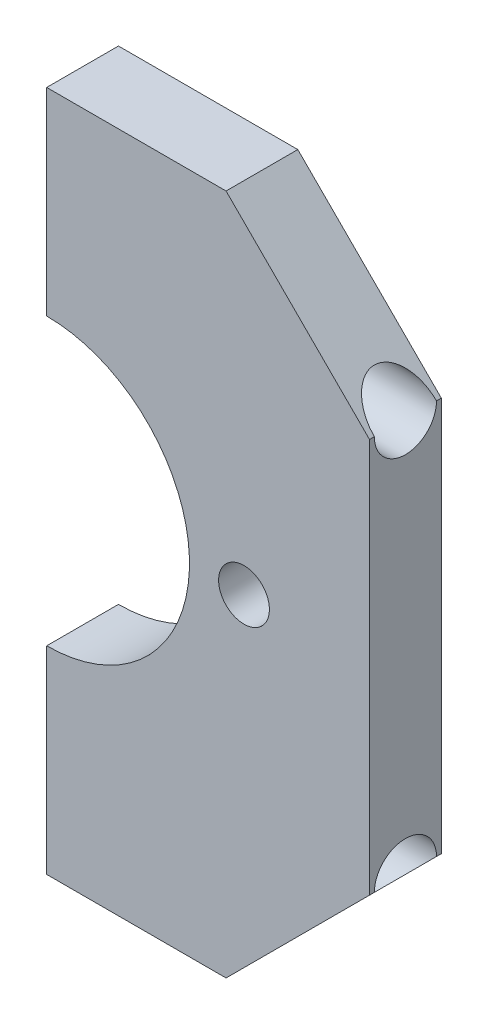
ISO-10303-21;
HEADER;
FILE_DESCRIPTION(('STEP AP214'),'2;1');
FILE_NAME('part.step','',(''),(''),'','','');
FILE_SCHEMA(('AUTOMOTIVE_DESIGN { 1 0 10303 214 1 1 1 1 }'));
ENDSEC;
DATA;
#1=APPLICATION_CONTEXT('core data for automotive mechanical design processes');
#2=APPLICATION_PROTOCOL_DEFINITION('international standard','automotive_design',2000,#1);
#3=PRODUCT_CONTEXT('',#1,'mechanical');
#4=PRODUCT('Part','Part','',(#3));
#5=PRODUCT_RELATED_PRODUCT_CATEGORY('part','',(#4));
#6=PRODUCT_DEFINITION_FORMATION('','',#4);
#7=PRODUCT_DEFINITION_CONTEXT('part definition',#1,'design');
#8=PRODUCT_DEFINITION('design','',#6,#7);
#9=PRODUCT_DEFINITION_SHAPE('','',#8);
#10=(LENGTH_UNIT() NAMED_UNIT(*) SI_UNIT(.MILLI.,.METRE.));
#11=(NAMED_UNIT(*) PLANE_ANGLE_UNIT() SI_UNIT($,.RADIAN.));
#12=(NAMED_UNIT(*) SI_UNIT($,.STERADIAN.) SOLID_ANGLE_UNIT());
#13=UNCERTAINTY_MEASURE_WITH_UNIT(LENGTH_MEASURE(1.E-05),#10,'distance_accuracy_value','');
#14=(GEOMETRIC_REPRESENTATION_CONTEXT(3) GLOBAL_UNCERTAINTY_ASSIGNED_CONTEXT((#13)) GLOBAL_UNIT_ASSIGNED_CONTEXT((#10,
#11,#12)) REPRESENTATION_CONTEXT('',''));
#15=CARTESIAN_POINT('',(0.,0.,0.));
#16=DIRECTION('',(0.,0.,1.));
#17=DIRECTION('',(1.,0.,0.));
#18=AXIS2_PLACEMENT_3D('',#15,#16,#17);
#19=CARTESIAN_POINT('',(57.15,-60.325,12.7));
#20=DIRECTION('',(-1.,0.,0.));
#21=DIRECTION('',(0.,0.,1.));
#22=AXIS2_PLACEMENT_3D('',#19,#20,#21);
#23=PLANE('',#22);
#24=CARTESIAN_POINT('',(57.15,34.925,6.35));
#25=DIRECTION('',(1.,0.,0.));
#26=DIRECTION('',(0.,0.,-1.));
#27=AXIS2_PLACEMENT_3D('',#24,#25,#26);
#28=CIRCLE('',#27,5.49910000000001);
#29=CARTESIAN_POINT('',(57.15,34.9249999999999,11.8491));
#30=VERTEX_POINT('',#29);
#31=CARTESIAN_POINT('',(57.15,34.9249999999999,0.850899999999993));
#32=VERTEX_POINT('',#31);
#33=EDGE_CURVE('E42',#30,#32,#28,.T.);
#34=ORIENTED_EDGE('',*,*,#33,.F.);
#35=DIRECTION('',(0.,0.,1.));
#36=VECTOR('',#35,1.);
#37=CARTESIAN_POINT('',(57.15,34.9249999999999,12.7));
#38=LINE('',#37,#36);
#39=CARTESIAN_POINT('',(57.15,34.9249999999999,12.7));
#40=VERTEX_POINT('',#39);
#41=EDGE_CURVE('E118',#30,#40,#38,.T.);
#42=ORIENTED_EDGE('',*,*,#41,.T.);
#43=DIRECTION('',(0.,1.,0.));
#44=VECTOR('',#43,1.);
#45=CARTESIAN_POINT('',(57.15,-60.325,12.7));
#46=LINE('',#45,#44);
#47=CARTESIAN_POINT('',(57.15,-34.9250000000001,12.7));
#48=VERTEX_POINT('',#47);
#49=EDGE_CURVE('E170',#48,#40,#46,.T.);
#50=ORIENTED_EDGE('',*,*,#49,.F.);
#51=DIRECTION('',(0.,0.,-1.));
#52=VECTOR('',#51,1.);
#53=CARTESIAN_POINT('',(57.15,-34.925,12.7));
#54=LINE('',#53,#52);
#55=CARTESIAN_POINT('',(57.15,-34.925,11.8491));
#56=VERTEX_POINT('',#55);
#57=EDGE_CURVE('E126',#48,#56,#54,.T.);
#58=ORIENTED_EDGE('',*,*,#57,.T.);
#59=CARTESIAN_POINT('',(57.15,-34.925,6.35));
#60=DIRECTION('',(1.,0.,0.));
#61=DIRECTION('',(0.,0.,-1.));
#62=AXIS2_PLACEMENT_3D('',#59,#60,#61);
#63=CIRCLE('',#62,5.49910000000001);
#64=CARTESIAN_POINT('',(57.15,-34.925,0.85089999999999));
#65=VERTEX_POINT('',#64);
#66=EDGE_CURVE('E53',#65,#56,#63,.T.);
#67=ORIENTED_EDGE('',*,*,#66,.F.);
#68=CARTESIAN_POINT('',(57.15,-34.925,0.));
#69=VERTEX_POINT('',#68);
#70=EDGE_CURVE('E144',#65,#69,#54,.T.);
#71=ORIENTED_EDGE('',*,*,#70,.T.);
#72=DIRECTION('',(0.,1.,0.));
#73=VECTOR('',#72,1.);
#74=CARTESIAN_POINT('',(57.15,-60.325,0.));
#75=LINE('',#74,#73);
#76=CARTESIAN_POINT('',(57.15,34.9249999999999,0.));
#77=VERTEX_POINT('',#76);
#78=EDGE_CURVE('E121',#69,#77,#75,.T.);
#79=ORIENTED_EDGE('',*,*,#78,.T.);
#80=EDGE_CURVE('E116',#77,#32,#38,.T.);
#81=ORIENTED_EDGE('',*,*,#80,.T.);
#82=EDGE_LOOP('',(#34,#42,#50,#58,#67,#71,#79,#81));
#83=FACE_BOUND('',#82,.T.);
#84=ADVANCED_FACE('F34',(#83),#23,.F.);
#85=CARTESIAN_POINT('',(0.,-60.325,12.7));
#86=DIRECTION('',(1.,0.,0.));
#87=DIRECTION('',(0.,0.,-1.));
#88=AXIS2_PLACEMENT_3D('',#85,#86,#87);
#89=PLANE('',#88);
#90=CARTESIAN_POINT('',(0.,34.925,6.35));
#91=DIRECTION('',(1.,0.,0.));
#92=DIRECTION('',(0.,0.,-1.));
#93=AXIS2_PLACEMENT_3D('',#90,#91,#92);
#94=CIRCLE('',#93,3.30200000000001);
#95=CARTESIAN_POINT('',(0.,34.925,3.04799999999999));
#96=VERTEX_POINT('',#95);
#97=EDGE_CURVE('E148',#96,#96,#94,.T.);
#98=ORIENTED_EDGE('',*,*,#97,.T.);
#99=EDGE_LOOP('',(#98));
#100=FACE_BOUND('',#99,.T.);
#101=DIRECTION('',(0.,-1.,0.));
#102=VECTOR('',#101,1.);
#103=CARTESIAN_POINT('',(0.,-60.325,0.));
#104=LINE('',#103,#102);
#105=CARTESIAN_POINT('',(0.,60.325,0.));
#106=VERTEX_POINT('',#105);
#107=CARTESIAN_POINT('',(0.,25.273,0.));
#108=VERTEX_POINT('',#107);
#109=EDGE_CURVE('E171',#106,#108,#104,.T.);
#110=ORIENTED_EDGE('',*,*,#109,.T.);
#111=DIRECTION('',(0.,0.,1.));
#112=VECTOR('',#111,1.);
#113=CARTESIAN_POINT('',(0.,25.273,0.));
#114=LINE('',#113,#112);
#115=CARTESIAN_POINT('',(0.,25.273,12.7));
#116=VERTEX_POINT('',#115);
#117=EDGE_CURVE('E136',#108,#116,#114,.T.);
#118=ORIENTED_EDGE('',*,*,#117,.T.);
#119=DIRECTION('',(0.,-1.,0.));
#120=VECTOR('',#119,1.);
#121=CARTESIAN_POINT('',(0.,-60.325,12.7));
#122=LINE('',#121,#120);
#123=CARTESIAN_POINT('',(0.,60.325,12.7));
#124=VERTEX_POINT('',#123);
#125=EDGE_CURVE('E181',#124,#116,#122,.T.);
#126=ORIENTED_EDGE('',*,*,#125,.F.);
#127=DIRECTION('',(0.,0.,-1.));
#128=VECTOR('',#127,1.);
#129=CARTESIAN_POINT('',(0.,60.325,12.7));
#130=LINE('',#129,#128);
#131=EDGE_CURVE('E160',#124,#106,#130,.T.);
#132=ORIENTED_EDGE('',*,*,#131,.T.);
#133=EDGE_LOOP('',(#110,#118,#126,#132));
#134=FACE_BOUND('',#133,.T.);
#135=ADVANCED_FACE('F226',(#100,#134),#89,.F.);
#136=CARTESIAN_POINT('',(57.15,60.325,12.7));
#137=DIRECTION('',(0.,0.,1.));
#138=DIRECTION('',(1.,0.,0.));
#139=AXIS2_PLACEMENT_3D('',#136,#137,#138);
#140=PLANE('',#139);
#141=CARTESIAN_POINT('',(0.,0.,12.7));
#142=DIRECTION('',(0.,0.,1.));
#143=DIRECTION('',(1.,0.,0.));
#144=AXIS2_PLACEMENT_3D('',#141,#142,#143);
#145=CIRCLE('',#144,25.273);
#146=CARTESIAN_POINT('',(0.,-25.273,12.7));
#147=VERTEX_POINT('',#146);
#148=EDGE_CURVE('E195',#147,#116,#145,.T.);
#149=ORIENTED_EDGE('',*,*,#148,.F.);
#150=CARTESIAN_POINT('',(0.,-60.325,12.7));
#151=VERTEX_POINT('',#150);
#152=EDGE_CURVE('E184',#147,#151,#122,.T.);
#153=ORIENTED_EDGE('',*,*,#152,.T.);
#154=DIRECTION('',(1.,0.,0.));
#155=VECTOR('',#154,1.);
#156=CARTESIAN_POINT('',(57.15,-60.325,12.7));
#157=LINE('',#156,#155);
#158=CARTESIAN_POINT('',(31.7499999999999,-60.325,12.7));
#159=VERTEX_POINT('',#158);
#160=EDGE_CURVE('E166',#151,#159,#157,.T.);
#161=ORIENTED_EDGE('',*,*,#160,.T.);
#162=DIRECTION('',(-0.707106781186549,-0.707106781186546,0.));
#163=VECTOR('',#162,1.);
#164=CARTESIAN_POINT('',(104.775,12.6999999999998,12.7));
#165=LINE('',#164,#163);
#166=EDGE_CURVE('E122',#159,#48,#165,.F.);
#167=ORIENTED_EDGE('',*,*,#166,.T.);
#168=ORIENTED_EDGE('',*,*,#49,.T.);
#169=DIRECTION('',(0.707106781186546,-0.707106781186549,0.));
#170=VECTOR('',#169,1.);
#171=CARTESIAN_POINT('',(44.45,47.625,12.7));
#172=LINE('',#171,#170);
#173=CARTESIAN_POINT('',(31.75,60.325,12.7));
#174=VERTEX_POINT('',#173);
#175=EDGE_CURVE('E124',#40,#174,#172,.F.);
#176=ORIENTED_EDGE('',*,*,#175,.T.);
#177=DIRECTION('',(-1.,0.,0.));
#178=VECTOR('',#177,1.);
#179=CARTESIAN_POINT('',(57.15,60.325,12.7));
#180=LINE('',#179,#178);
#181=EDGE_CURVE('E185',#174,#124,#180,.T.);
#182=ORIENTED_EDGE('',*,*,#181,.T.);
#183=ORIENTED_EDGE('',*,*,#125,.T.);
#184=EDGE_LOOP('',(#149,#153,#161,#167,#168,#176,#182,#183));
#185=FACE_BOUND('',#184,.T.);
#186=CARTESIAN_POINT('',(34.925,0.,12.7));
#187=DIRECTION('',(0.,0.,1.));
#188=DIRECTION('',(1.,0.,0.));
#189=AXIS2_PLACEMENT_3D('',#186,#187,#188);
#190=CIRCLE('',#189,4.4958);
#191=CARTESIAN_POINT('',(39.4208,0.,12.7));
#192=VERTEX_POINT('',#191);
#193=EDGE_CURVE('E178',#192,#192,#190,.T.);
#194=ORIENTED_EDGE('',*,*,#193,.F.);
#195=EDGE_LOOP('',(#194));
#196=FACE_BOUND('',#195,.T.);
#197=ADVANCED_FACE('F231',(#185,#196),#140,.T.);
#198=CARTESIAN_POINT('',(57.15,60.325,0.));
#199=DIRECTION('',(0.,0.,1.));
#200=DIRECTION('',(1.,0.,0.));
#201=AXIS2_PLACEMENT_3D('',#198,#199,#200);
#202=PLANE('',#201);
#203=CARTESIAN_POINT('',(0.,-25.273,0.));
#204=VERTEX_POINT('',#203);
#205=CARTESIAN_POINT('',(0.,-60.325,0.));
#206=VERTEX_POINT('',#205);
#207=EDGE_CURVE('E174',#204,#206,#104,.T.);
#208=ORIENTED_EDGE('',*,*,#207,.F.);
#209=CARTESIAN_POINT('',(0.,0.,0.));
#210=DIRECTION('',(0.,0.,1.));
#211=DIRECTION('',(1.,0.,0.));
#212=AXIS2_PLACEMENT_3D('',#209,#210,#211);
#213=CIRCLE('',#212,25.273);
#214=EDGE_CURVE('E192',#204,#108,#213,.T.);
#215=ORIENTED_EDGE('',*,*,#214,.T.);
#216=ORIENTED_EDGE('',*,*,#109,.F.);
#217=DIRECTION('',(-1.,0.,0.));
#218=VECTOR('',#217,1.);
#219=CARTESIAN_POINT('',(57.15,60.325,0.));
#220=LINE('',#219,#218);
#221=CARTESIAN_POINT('',(31.75,60.325,0.));
#222=VERTEX_POINT('',#221);
#223=EDGE_CURVE('E175',#222,#106,#220,.T.);
#224=ORIENTED_EDGE('',*,*,#223,.F.);
#225=DIRECTION('',(-0.707106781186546,0.707106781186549,0.));
#226=VECTOR('',#225,1.);
#227=CARTESIAN_POINT('',(31.75,60.325,0.));
#228=LINE('',#227,#226);
#229=EDGE_CURVE('E152',#222,#77,#228,.F.);
#230=ORIENTED_EDGE('',*,*,#229,.T.);
#231=ORIENTED_EDGE('',*,*,#78,.F.);
#232=DIRECTION('',(0.707106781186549,0.707106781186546,0.));
#233=VECTOR('',#232,1.);
#234=CARTESIAN_POINT('',(57.15,-34.925,0.));
#235=LINE('',#234,#233);
#236=CARTESIAN_POINT('',(31.7499999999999,-60.325,0.));
#237=VERTEX_POINT('',#236);
#238=EDGE_CURVE('E151',#69,#237,#235,.F.);
#239=ORIENTED_EDGE('',*,*,#238,.T.);
#240=DIRECTION('',(1.,0.,0.));
#241=VECTOR('',#240,1.);
#242=CARTESIAN_POINT('',(57.15,-60.325,0.));
#243=LINE('',#242,#241);
#244=EDGE_CURVE('E167',#206,#237,#243,.T.);
#245=ORIENTED_EDGE('',*,*,#244,.F.);
#246=EDGE_LOOP('',(#208,#215,#216,#224,#230,#231,#239,#245));
#247=FACE_BOUND('',#246,.T.);
#248=CARTESIAN_POINT('',(34.925,0.,0.));
#249=DIRECTION('',(0.,0.,1.));
#250=DIRECTION('',(1.,0.,0.));
#251=AXIS2_PLACEMENT_3D('',#248,#249,#250);
#252=CIRCLE('',#251,4.4958);
#253=CARTESIAN_POINT('',(39.4208,0.,0.));
#254=VERTEX_POINT('',#253);
#255=EDGE_CURVE('E189',#254,#254,#252,.T.);
#256=ORIENTED_EDGE('',*,*,#255,.T.);
#257=EDGE_LOOP('',(#256));
#258=FACE_BOUND('',#257,.T.);
#259=ADVANCED_FACE('F258',(#247,#258),#202,.F.);
#260=CARTESIAN_POINT('',(57.15,60.325,12.7));
#261=DIRECTION('',(0.,-1.,0.));
#262=DIRECTION('',(1.,0.,0.));
#263=AXIS2_PLACEMENT_3D('',#260,#261,#262);
#264=PLANE('',#263);
#265=ORIENTED_EDGE('',*,*,#181,.F.);
#266=DIRECTION('',(0.,0.,-1.));
#267=VECTOR('',#266,1.);
#268=CARTESIAN_POINT('',(31.75,60.325,12.7));
#269=LINE('',#268,#267);
#270=EDGE_CURVE('E155',#174,#222,#269,.T.);
#271=ORIENTED_EDGE('',*,*,#270,.T.);
#272=ORIENTED_EDGE('',*,*,#223,.T.);
#273=ORIENTED_EDGE('',*,*,#131,.F.);
#274=EDGE_LOOP('',(#265,#271,#272,#273));
#275=FACE_BOUND('',#274,.T.);
#276=ADVANCED_FACE('F236',(#275),#264,.F.);
#277=CARTESIAN_POINT('',(0.,-34.925,6.35));
#278=DIRECTION('',(1.,0.,0.));
#279=DIRECTION('',(0.,0.,-1.));
#280=AXIS2_PLACEMENT_3D('',#277,#278,#279);
#281=CIRCLE('',#280,3.30200000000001);
#282=CARTESIAN_POINT('',(0.,-34.925,3.04799999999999));
#283=VERTEX_POINT('',#282);
#284=EDGE_CURVE('E197',#283,#283,#281,.T.);
#285=ORIENTED_EDGE('',*,*,#284,.T.);
#286=EDGE_LOOP('',(#285));
#287=FACE_BOUND('',#286,.T.);
#288=ORIENTED_EDGE('',*,*,#152,.F.);
#289=DIRECTION('',(0.,0.,1.));
#290=VECTOR('',#289,1.);
#291=CARTESIAN_POINT('',(0.,-25.273,0.));
#292=LINE('',#291,#290);
#293=EDGE_CURVE('E133',#147,#204,#292,.F.);
#294=ORIENTED_EDGE('',*,*,#293,.T.);
#295=ORIENTED_EDGE('',*,*,#207,.T.);
#296=DIRECTION('',(0.,0.,-1.));
#297=VECTOR('',#296,1.);
#298=CARTESIAN_POINT('',(0.,-60.325,12.7));
#299=LINE('',#298,#297);
#300=EDGE_CURVE('E163',#151,#206,#299,.T.);
#301=ORIENTED_EDGE('',*,*,#300,.F.);
#302=EDGE_LOOP('',(#288,#294,#295,#301));
#303=FACE_BOUND('',#302,.T.);
#304=ADVANCED_FACE('F234',(#287,#303),#89,.F.);
#305=CARTESIAN_POINT('',(57.15,-60.325,12.7));
#306=DIRECTION('',(0.,1.,0.));
#307=DIRECTION('',(-1.,0.,0.));
#308=AXIS2_PLACEMENT_3D('',#305,#306,#307);
#309=PLANE('',#308);
#310=ORIENTED_EDGE('',*,*,#244,.T.);
#311=DIRECTION('',(0.,0.,1.));
#312=VECTOR('',#311,1.);
#313=CARTESIAN_POINT('',(31.7499999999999,-60.325,12.7));
#314=LINE('',#313,#312);
#315=EDGE_CURVE('E131',#237,#159,#314,.T.);
#316=ORIENTED_EDGE('',*,*,#315,.T.);
#317=ORIENTED_EDGE('',*,*,#160,.F.);
#318=ORIENTED_EDGE('',*,*,#300,.T.);
#319=EDGE_LOOP('',(#310,#316,#317,#318));
#320=FACE_BOUND('',#319,.T.);
#321=ADVANCED_FACE('F244',(#320),#309,.F.);
#322=CARTESIAN_POINT('',(34.925,0.,12.7));
#323=DIRECTION('',(0.,0.,-1.));
#324=DIRECTION('',(-1.,0.,0.));
#325=AXIS2_PLACEMENT_3D('',#322,#323,#324);
#326=CYLINDRICAL_SURFACE('',#325,4.4958);
#327=ORIENTED_EDGE('',*,*,#193,.T.);
#328=EDGE_LOOP('',(#327));
#329=FACE_BOUND('',#328,.T.);
#330=ORIENTED_EDGE('',*,*,#255,.F.);
#331=EDGE_LOOP('',(#330));
#332=FACE_BOUND('',#331,.T.);
#333=ADVANCED_FACE('F238',(#329,#332),#326,.F.);
#334=CARTESIAN_POINT('',(31.75,60.325,12.7));
#335=DIRECTION('',(-0.707106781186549,-0.707106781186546,0.));
#336=DIRECTION('',(0.707106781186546,-0.707106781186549,0.));
#337=AXIS2_PLACEMENT_3D('',#334,#335,#336);
#338=PLANE('',#337);
#339=CARTESIAN_POINT('',(57.1499999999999,34.925,6.35));
#340=DIRECTION('',(-0.707106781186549,-0.707106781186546,0.));
#341=DIRECTION('',(0.707106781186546,-0.707106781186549,0.));
#342=AXIS2_PLACEMENT_3D('',#339,#340,#341);
#343=ELLIPSE('',#342,7.77690180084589,5.49910000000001);
#344=EDGE_CURVE('E11',#32,#30,#343,.F.);
#345=ORIENTED_EDGE('',*,*,#344,.F.);
#346=ORIENTED_EDGE('',*,*,#80,.F.);
#347=ORIENTED_EDGE('',*,*,#229,.F.);
#348=ORIENTED_EDGE('',*,*,#270,.F.);
#349=ORIENTED_EDGE('',*,*,#175,.F.);
#350=ORIENTED_EDGE('',*,*,#41,.F.);
#351=EDGE_LOOP('',(#345,#346,#347,#348,#349,#350));
#352=FACE_BOUND('',#351,.T.);
#353=ADVANCED_FACE('F115',(#352),#338,.F.);
#354=CARTESIAN_POINT('',(57.15,-34.925,12.7));
#355=DIRECTION('',(-0.707106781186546,0.707106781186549,0.));
#356=DIRECTION('',(-0.707106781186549,-0.707106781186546,0.));
#357=AXIS2_PLACEMENT_3D('',#354,#355,#356);
#358=PLANE('',#357);
#359=CARTESIAN_POINT('',(57.15,-34.925,6.35));
#360=DIRECTION('',(-0.707106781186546,0.707106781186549,0.));
#361=DIRECTION('',(0.707106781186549,0.707106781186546,0.));
#362=AXIS2_PLACEMENT_3D('',#359,#360,#361);
#363=ELLIPSE('',#362,7.77690180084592,5.49910000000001);
#364=EDGE_CURVE('E111',#56,#65,#363,.F.);
#365=ORIENTED_EDGE('',*,*,#364,.F.);
#366=ORIENTED_EDGE('',*,*,#57,.F.);
#367=ORIENTED_EDGE('',*,*,#166,.F.);
#368=ORIENTED_EDGE('',*,*,#315,.F.);
#369=ORIENTED_EDGE('',*,*,#238,.F.);
#370=ORIENTED_EDGE('',*,*,#70,.F.);
#371=EDGE_LOOP('',(#365,#366,#367,#368,#369,#370));
#372=FACE_BOUND('',#371,.T.);
#373=ADVANCED_FACE('F36',(#372),#358,.F.);
#374=CARTESIAN_POINT('',(0.,0.,0.));
#375=DIRECTION('',(0.,0.,1.));
#376=DIRECTION('',(1.,0.,0.));
#377=AXIS2_PLACEMENT_3D('',#374,#375,#376);
#378=CYLINDRICAL_SURFACE('',#377,25.273);
#379=ORIENTED_EDGE('',*,*,#214,.F.);
#380=ORIENTED_EDGE('',*,*,#293,.F.);
#381=ORIENTED_EDGE('',*,*,#148,.T.);
#382=ORIENTED_EDGE('',*,*,#117,.F.);
#383=EDGE_LOOP('',(#379,#380,#381,#382));
#384=FACE_BOUND('',#383,.T.);
#385=ADVANCED_FACE('F243',(#384),#378,.F.);
#386=CARTESIAN_POINT('',(57.15,-34.925,6.35));
#387=DIRECTION('',(1.,0.,0.));
#388=DIRECTION('',(0.,0.,-1.));
#389=AXIS2_PLACEMENT_3D('',#386,#387,#388);
#390=CYLINDRICAL_SURFACE('',#389,3.30200000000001);
#391=ORIENTED_EDGE('',*,*,#284,.F.);
#392=EDGE_LOOP('',(#391));
#393=FACE_BOUND('',#392,.T.);
#394=CARTESIAN_POINT('',(30.226,-34.925,6.35));
#395=DIRECTION('',(1.,0.,0.));
#396=DIRECTION('',(0.,0.,-1.));
#397=AXIS2_PLACEMENT_3D('',#394,#395,#396);
#398=CIRCLE('',#397,3.30200000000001);
#399=CARTESIAN_POINT('',(30.226,-34.925,3.04799999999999));
#400=VERTEX_POINT('',#399);
#401=EDGE_CURVE('E202',#400,#400,#398,.T.);
#402=ORIENTED_EDGE('',*,*,#401,.T.);
#403=EDGE_LOOP('',(#402));
#404=FACE_BOUND('',#403,.T.);
#405=ADVANCED_FACE('F287',(#393,#404),#390,.F.);
#406=CARTESIAN_POINT('',(30.226,-31.623,6.35));
#407=DIRECTION('',(-1.,0.,0.));
#408=DIRECTION('',(0.,0.,1.));
#409=AXIS2_PLACEMENT_3D('',#406,#407,#408);
#410=PLANE('',#409);
#411=ORIENTED_EDGE('',*,*,#401,.F.);
#412=EDGE_LOOP('',(#411));
#413=FACE_BOUND('',#412,.T.);
#414=CARTESIAN_POINT('',(30.226,-34.925,6.35));
#415=DIRECTION('',(1.,0.,0.));
#416=DIRECTION('',(0.,0.,-1.));
#417=AXIS2_PLACEMENT_3D('',#414,#415,#416);
#418=CIRCLE('',#417,5.49910000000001);
#419=CARTESIAN_POINT('',(30.226,-34.925,0.85089999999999));
#420=VERTEX_POINT('',#419);
#421=EDGE_CURVE('E147',#420,#420,#418,.T.);
#422=ORIENTED_EDGE('',*,*,#421,.T.);
#423=EDGE_LOOP('',(#422));
#424=FACE_BOUND('',#423,.T.);
#425=ADVANCED_FACE('F291',(#413,#424),#410,.F.);
#426=CARTESIAN_POINT('',(57.15,-34.925,6.35));
#427=DIRECTION('',(1.,0.,0.));
#428=DIRECTION('',(0.,0.,-1.));
#429=AXIS2_PLACEMENT_3D('',#426,#427,#428);
#430=CYLINDRICAL_SURFACE('',#429,5.49910000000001);
#431=ORIENTED_EDGE('',*,*,#364,.T.);
#432=ORIENTED_EDGE('',*,*,#66,.T.);
#433=EDGE_LOOP('',(#431,#432));
#434=FACE_BOUND('',#433,.T.);
#435=ORIENTED_EDGE('',*,*,#421,.F.);
#436=EDGE_LOOP('',(#435));
#437=FACE_BOUND('',#436,.T.);
#438=ADVANCED_FACE('F138',(#434,#437),#430,.F.);
#439=CARTESIAN_POINT('',(57.15,34.925,6.35));
#440=DIRECTION('',(1.,0.,0.));
#441=DIRECTION('',(0.,0.,-1.));
#442=AXIS2_PLACEMENT_3D('',#439,#440,#441);
#443=CYLINDRICAL_SURFACE('',#442,3.30200000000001);
#444=ORIENTED_EDGE('',*,*,#97,.F.);
#445=EDGE_LOOP('',(#444));
#446=FACE_BOUND('',#445,.T.);
#447=CARTESIAN_POINT('',(30.226,34.925,6.35));
#448=DIRECTION('',(1.,0.,0.));
#449=DIRECTION('',(0.,0.,-1.));
#450=AXIS2_PLACEMENT_3D('',#447,#448,#449);
#451=CIRCLE('',#450,3.30200000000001);
#452=CARTESIAN_POINT('',(30.226,34.925,3.04799999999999));
#453=VERTEX_POINT('',#452);
#454=EDGE_CURVE('E209',#453,#453,#451,.T.);
#455=ORIENTED_EDGE('',*,*,#454,.T.);
#456=EDGE_LOOP('',(#455));
#457=FACE_BOUND('',#456,.T.);
#458=ADVANCED_FACE('F222',(#446,#457),#443,.F.);
#459=CARTESIAN_POINT('',(30.226,38.227,6.35));
#460=DIRECTION('',(-1.,0.,0.));
#461=DIRECTION('',(0.,0.,1.));
#462=AXIS2_PLACEMENT_3D('',#459,#460,#461);
#463=PLANE('',#462);
#464=ORIENTED_EDGE('',*,*,#454,.F.);
#465=EDGE_LOOP('',(#464));
#466=FACE_BOUND('',#465,.T.);
#467=CARTESIAN_POINT('',(30.226,34.925,6.35));
#468=DIRECTION('',(1.,0.,0.));
#469=DIRECTION('',(0.,0.,-1.));
#470=AXIS2_PLACEMENT_3D('',#467,#468,#469);
#471=CIRCLE('',#470,5.49910000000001);
#472=CARTESIAN_POINT('',(30.226,34.925,0.850899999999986));
#473=VERTEX_POINT('',#472);
#474=EDGE_CURVE('E212',#473,#473,#471,.T.);
#475=ORIENTED_EDGE('',*,*,#474,.T.);
#476=EDGE_LOOP('',(#475));
#477=FACE_BOUND('',#476,.T.);
#478=ADVANCED_FACE('F216',(#466,#477),#463,.F.);
#479=CARTESIAN_POINT('',(57.15,34.925,6.35));
#480=DIRECTION('',(1.,0.,0.));
#481=DIRECTION('',(0.,0.,-1.));
#482=AXIS2_PLACEMENT_3D('',#479,#480,#481);
#483=CYLINDRICAL_SURFACE('',#482,5.49910000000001);
#484=ORIENTED_EDGE('',*,*,#344,.T.);
#485=ORIENTED_EDGE('',*,*,#33,.T.);
#486=EDGE_LOOP('',(#484,#485));
#487=FACE_BOUND('',#486,.T.);
#488=ORIENTED_EDGE('',*,*,#474,.F.);
#489=EDGE_LOOP('',(#488));
#490=FACE_BOUND('',#489,.T.);
#491=ADVANCED_FACE('F106',(#487,#490),#483,.F.);
#492=CLOSED_SHELL('',(#84,#135,#197,#259,#276,#304,#321,#333,#353,#373,#385,#405,#425,#438,#458,
#478,#491));
#493=MANIFOLD_SOLID_BREP('B2',#492);
#494=ADVANCED_BREP_SHAPE_REPRESENTATION('',(#18,#493),#14);
#495=SHAPE_DEFINITION_REPRESENTATION(#9,#494);
ENDSEC;
END-ISO-10303-21;
